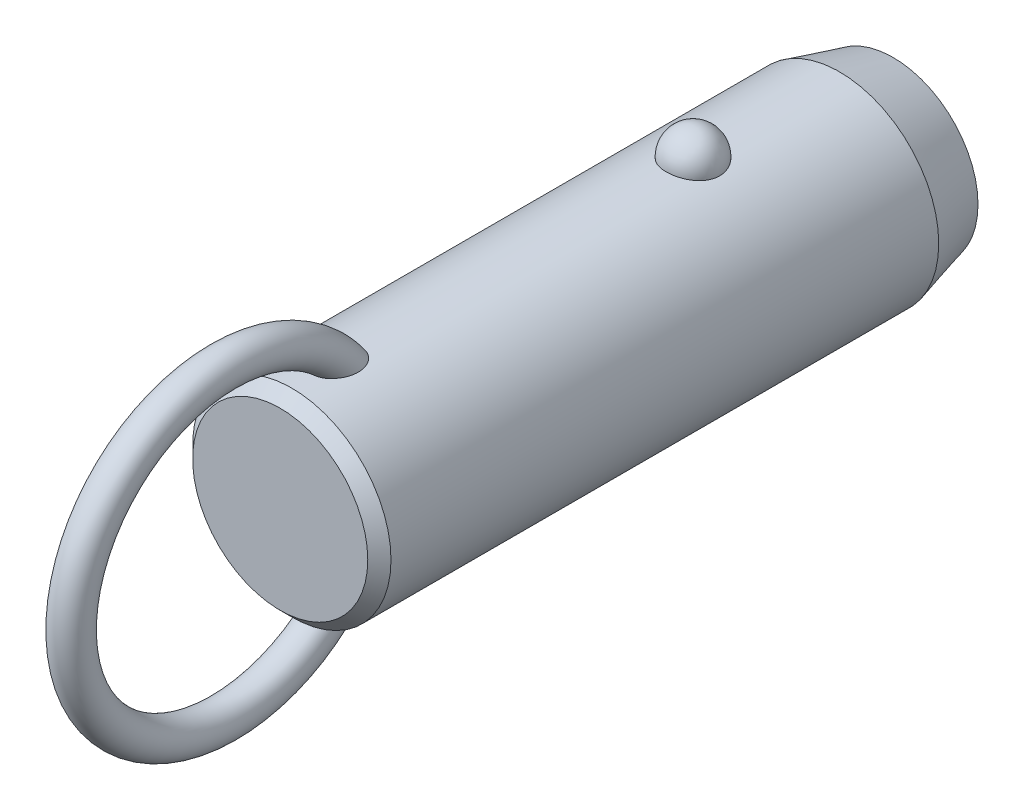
ISO-10303-21;
HEADER;
FILE_DESCRIPTION(('STEP AP214'),'2;1');
FILE_NAME('part.step','',(''),(''),'','','');
FILE_SCHEMA(('AUTOMOTIVE_DESIGN { 1 0 10303 214 1 1 1 1 }'));
ENDSEC;
DATA;
#1=APPLICATION_CONTEXT('core data for automotive mechanical design processes');
#2=APPLICATION_PROTOCOL_DEFINITION('international standard','automotive_design',2000,#1);
#3=PRODUCT_CONTEXT('',#1,'mechanical');
#4=PRODUCT('Part','Part','',(#3));
#5=PRODUCT_RELATED_PRODUCT_CATEGORY('part','',(#4));
#6=PRODUCT_DEFINITION_FORMATION('','',#4);
#7=PRODUCT_DEFINITION_CONTEXT('part definition',#1,'design');
#8=PRODUCT_DEFINITION('design','',#6,#7);
#9=PRODUCT_DEFINITION_SHAPE('','',#8);
#10=(LENGTH_UNIT() NAMED_UNIT(*) SI_UNIT(.MILLI.,.METRE.));
#11=(NAMED_UNIT(*) PLANE_ANGLE_UNIT() SI_UNIT($,.RADIAN.));
#12=(NAMED_UNIT(*) SI_UNIT($,.STERADIAN.) SOLID_ANGLE_UNIT());
#13=UNCERTAINTY_MEASURE_WITH_UNIT(LENGTH_MEASURE(1.E-05),#10,'distance_accuracy_value','');
#14=(GEOMETRIC_REPRESENTATION_CONTEXT(3) GLOBAL_UNCERTAINTY_ASSIGNED_CONTEXT((#13)) GLOBAL_UNIT_ASSIGNED_CONTEXT((#10,
#11,#12)) REPRESENTATION_CONTEXT('',''));
#15=CARTESIAN_POINT('',(0.,0.,0.));
#16=DIRECTION('',(0.,0.,1.));
#17=DIRECTION('',(1.,0.,0.));
#18=AXIS2_PLACEMENT_3D('',#15,#16,#17);
#19=CARTESIAN_POINT('',(0.,0.,30.5));
#20=DIRECTION('',(0.,0.,-1.));
#21=DIRECTION('',(-1.,0.,0.));
#22=AXIS2_PLACEMENT_3D('',#19,#20,#21);
#23=CYLINDRICAL_SURFACE('',#22,11.1);
#24=CARTESIAN_POINT('',(2.9724815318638,10.6945945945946,-3.));
#25=CARTESIAN_POINT('',(2.9724783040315,10.6945972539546,-2.83225059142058));
#26=CARTESIAN_POINT('',(2.95876598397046,10.6984356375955,-2.6644597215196));
#27=CARTESIAN_POINT('',(2.90424529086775,10.7133624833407,-2.33362381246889));
#28=CARTESIAN_POINT('',(2.8634252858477,10.7244540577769,-2.1705808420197));
#29=CARTESIAN_POINT('',(2.75573657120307,10.7526272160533,-1.85396767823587));
#30=CARTESIAN_POINT('',(2.68887937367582,10.7697061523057,-1.70039333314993));
#31=CARTESIAN_POINT('',(2.53079696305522,10.8079438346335,-1.40691598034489));
#32=CARTESIAN_POINT('',(2.43957264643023,10.8291024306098,-1.2670124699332));
#33=CARTESIAN_POINT('',(2.23458150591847,10.8732541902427,-1.00409565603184));
#34=CARTESIAN_POINT('',(2.12071295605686,10.8962553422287,-0.881162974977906));
#35=CARTESIAN_POINT('',(1.87365402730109,10.9414421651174,-0.656352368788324));
#36=CARTESIAN_POINT('',(1.74046358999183,10.9636278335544,-0.554474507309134));
#37=CARTESIAN_POINT('',(1.45872188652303,11.0046495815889,-0.374872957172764));
#38=CARTESIAN_POINT('',(1.31021276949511,11.0234944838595,-0.29708522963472));
#39=CARTESIAN_POINT('',(1.00170030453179,11.0557957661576,-0.167529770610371));
#40=CARTESIAN_POINT('',(0.841698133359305,11.0692526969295,-0.115759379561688));
#41=CARTESIAN_POINT('',(0.517607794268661,11.0890932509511,-0.0403925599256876));
#42=CARTESIAN_POINT('',(0.353633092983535,11.0955916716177,-0.0163383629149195));
#43=CARTESIAN_POINT('',(0.0238420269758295,11.1011989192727,0.0044517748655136));
#44=CARTESIAN_POINT('',(-0.141974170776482,11.1003084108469,0.00119017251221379));
#45=CARTESIAN_POINT('',(-0.468405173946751,11.0912990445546,-0.0323233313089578));
#46=CARTESIAN_POINT('',(-0.629059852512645,11.0832767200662,-0.062214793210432));
#47=CARTESIAN_POINT('',(-0.942937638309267,11.0609962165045,-0.147645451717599));
#48=CARTESIAN_POINT('',(-1.09616062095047,11.0467379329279,-0.203185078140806));
#49=CARTESIAN_POINT('',(-1.39181061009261,11.0134071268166,-0.338752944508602));
#50=CARTESIAN_POINT('',(-1.53417383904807,10.9943086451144,-0.418913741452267));
#51=CARTESIAN_POINT('',(-1.80342160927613,10.9533667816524,-0.601448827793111));
#52=CARTESIAN_POINT('',(-1.9303046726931,10.9315231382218,-0.703825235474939));
#53=CARTESIAN_POINT('',(-2.16747598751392,10.887005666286,-0.930091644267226));
#54=CARTESIAN_POINT('',(-2.27742774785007,10.8643239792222,-1.05433291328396));
#55=CARTESIAN_POINT('',(-2.47517316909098,10.8209886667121,-1.31966633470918));
#56=CARTESIAN_POINT('',(-2.56296538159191,10.8003351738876,-1.46075958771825));
#57=CARTESIAN_POINT('',(-2.71500300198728,10.7631304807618,-1.75753646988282));
#58=CARTESIAN_POINT('',(-2.77898901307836,10.7466250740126,-1.91335887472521));
#59=CARTESIAN_POINT('',(-2.88046189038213,10.7198747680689,-2.2339152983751));
#60=CARTESIAN_POINT('',(-2.91794947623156,10.709629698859,-2.39864907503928));
#61=CARTESIAN_POINT('',(-2.96537819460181,10.6965949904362,-2.73165170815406));
#62=CARTESIAN_POINT('',(-2.97542891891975,10.693775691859,-2.89990378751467));
#63=CARTESIAN_POINT('',(-2.96804271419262,10.6958279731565,-3.235752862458));
#64=CARTESIAN_POINT('',(-2.95060646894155,10.7006993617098,-3.40334987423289));
#65=CARTESIAN_POINT('',(-2.88883358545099,10.71753912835,-3.73233906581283));
#66=CARTESIAN_POINT('',(-2.84462026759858,10.7294749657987,-3.89375610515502));
#67=CARTESIAN_POINT('',(-2.73050447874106,10.7590797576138,-4.20667949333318));
#68=CARTESIAN_POINT('',(-2.66060103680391,10.7767489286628,-4.35818546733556));
#69=CARTESIAN_POINT('',(-2.49642559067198,10.8159599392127,-4.6478542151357));
#70=CARTESIAN_POINT('',(-2.40203047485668,10.8375211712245,-4.78594458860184));
#71=CARTESIAN_POINT('',(-2.19143488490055,10.8820570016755,-5.0441038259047));
#72=CARTESIAN_POINT('',(-2.07523364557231,10.9050316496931,-5.16417205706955));
#73=CARTESIAN_POINT('',(-1.82361254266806,10.9499219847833,-5.38334833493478));
#74=CARTESIAN_POINT('',(-1.68812945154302,10.9718338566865,-5.48238464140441));
#75=CARTESIAN_POINT('',(-1.40191298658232,11.0120611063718,-5.65618873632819));
#76=CARTESIAN_POINT('',(-1.25118062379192,11.0303767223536,-5.73095813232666));
#77=CARTESIAN_POINT('',(-0.940570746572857,11.0611653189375,-5.85334725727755));
#78=CARTESIAN_POINT('',(-0.780821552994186,11.0737044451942,-5.90127578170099));
#79=CARTESIAN_POINT('',(-0.455204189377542,11.0918598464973,-5.96992976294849));
#80=CARTESIAN_POINT('',(-0.289336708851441,11.0974768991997,-5.99065827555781));
#81=CARTESIAN_POINT('',(0.0406846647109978,11.1011307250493,-6.00418773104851));
#82=CARTESIAN_POINT('',(0.20481742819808,11.099299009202,-5.99747318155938));
#83=CARTESIAN_POINT('',(0.529553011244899,11.088551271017,-5.9574031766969));
#84=CARTESIAN_POINT('',(0.69015594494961,11.0796354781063,-5.92404858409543));
#85=CARTESIAN_POINT('',(1.0027760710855,11.0557204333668,-5.83180084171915));
#86=CARTESIAN_POINT('',(1.15482001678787,11.0407414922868,-5.77299291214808));
#87=CARTESIAN_POINT('',(1.44678373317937,11.0062913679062,-5.63147366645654));
#88=CARTESIAN_POINT('',(1.58670279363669,10.9868199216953,-5.54876095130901));
#89=CARTESIAN_POINT('',(1.8527023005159,10.9451315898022,-5.36027644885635));
#90=CARTESIAN_POINT('',(1.97855158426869,10.9228788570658,-5.25418644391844));
#91=CARTESIAN_POINT('',(2.21080872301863,10.8782509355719,-5.02251354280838));
#92=CARTESIAN_POINT('',(2.31721312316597,10.8558757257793,-4.89692718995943));
#93=CARTESIAN_POINT('',(2.50945517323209,10.8130715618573,-4.62745408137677));
#94=CARTESIAN_POINT('',(2.59493284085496,10.7926798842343,-4.48330448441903));
#95=CARTESIAN_POINT('',(2.740862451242,10.7565495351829,-4.18236358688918));
#96=CARTESIAN_POINT('',(2.80132490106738,10.7408089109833,-4.02557762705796));
#97=CARTESIAN_POINT('',(2.88959070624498,10.7173718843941,-3.72475308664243));
#98=CARTESIAN_POINT('',(2.92062102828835,10.7088950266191,-3.58171216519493));
#99=CARTESIAN_POINT('',(2.96206765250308,10.6975052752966,-3.29245795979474));
#100=CARTESIAN_POINT('',(2.97248434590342,10.6945922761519,-3.14624473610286));
#101=CARTESIAN_POINT('',(2.9724815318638,10.6945945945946,-3.));
#102=B_SPLINE_CURVE_WITH_KNOTS('',3,(#24,#25,#26,#27,#28,#29,#30,#31,#32,#33,#34,#35,#36,#37,
#38,#39,#40,#41,#42,#43,#44,#45,#46,#47,#48,#49,#50,#51,#52,#53,#54,#55,#56,#57,#58,#59,#60,#61,
#62,#63,#64,#65,#66,#67,#68,#69,#70,#71,#72,#73,#74,#75,#76,#77,#78,#79,#80,#81,#82,#83,#84,#85,
#86,#87,#88,#89,#90,#91,#92,#93,#94,#95,#96,#97,#98,#99,#100,#101),.UNSPECIFIED.,.T.,.F.,(4,2,2,
2,2,2,2,2,2,2,2,2,2,2,2,2,2,2,2,2,2,2,2,2,2,2,2,2,2,2,2,2,2,2,2,2,2,2,4),(0.,0.502722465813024,
1.00566079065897,1.5083769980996,2.01107471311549,2.51608392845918,3.02109467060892,
3.52475118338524,4.02835620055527,4.52351860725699,5.0186364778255,5.50715297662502,
5.99567766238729,6.48688002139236,6.97812923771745,7.47814366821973,7.97819077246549,
8.48353712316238,8.9888697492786,9.49218093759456,9.99547960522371,10.4964777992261,
10.997494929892,11.5010810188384,12.0046847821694,12.5099796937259,13.0152411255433,
13.5145635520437,14.0138298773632,14.5043200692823,14.9947943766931,15.4836390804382,
15.9725123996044,16.4685040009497,16.9645836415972,17.4686765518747,17.972557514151,
18.410841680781,18.849117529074),.UNSPECIFIED.);
#103=CARTESIAN_POINT('',(2.9724815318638,10.6945945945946,-3.));
#104=VERTEX_POINT('',#103);
#105=EDGE_CURVE('E41',#104,#104,#102,.T.);
#106=ORIENTED_EDGE('',*,*,#105,.T.);
#107=EDGE_LOOP('',(#106));
#108=FACE_BOUND('',#107,.T.);
#109=CARTESIAN_POINT('',(0.,0.,41.9000000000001));
#110=DIRECTION('',(0.,0.,1.));
#111=DIRECTION('',(1.,0.,0.));
#112=AXIS2_PLACEMENT_3D('',#109,#110,#111);
#113=CIRCLE('',#112,11.1);
#114=CARTESIAN_POINT('',(11.1,0.,41.9000000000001));
#115=VERTEX_POINT('',#114);
#116=EDGE_CURVE('E10',#115,#115,#113,.F.);
#117=ORIENTED_EDGE('',*,*,#116,.T.);
#118=EDGE_LOOP('',(#117));
#119=FACE_BOUND('',#118,.T.);
#120=CARTESIAN_POINT('',(-0.56452033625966,-11.0856356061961,34.157815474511));
#121=CARTESIAN_POINT('',(-0.66720283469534,-11.0804062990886,34.1912839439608));
#122=CARTESIAN_POINT('',(-0.766875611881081,-11.0738877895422,34.2338357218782));
#123=CARTESIAN_POINT('',(-0.957284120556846,-11.0590576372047,34.3354190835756));
#124=CARTESIAN_POINT('',(-1.04801616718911,-11.0507452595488,34.3944574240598));
#125=CARTESIAN_POINT('',(-1.21800952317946,-11.0333016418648,34.5265293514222));
#126=CARTESIAN_POINT('',(-1.29730805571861,-11.0241732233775,34.5995156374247));
#127=CARTESIAN_POINT('',(-1.44337665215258,-11.0060026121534,34.7570374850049));
#128=CARTESIAN_POINT('',(-1.51014622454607,-10.9969604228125,34.8415734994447));
#129=CARTESIAN_POINT('',(-1.63454620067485,-10.9791841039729,35.0255213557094));
#130=CARTESIAN_POINT('',(-1.69127003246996,-10.9705107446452,35.1255493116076));
#131=CARTESIAN_POINT('',(-1.78980785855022,-10.9548648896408,35.3327902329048));
#132=CARTESIAN_POINT('',(-1.83161214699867,-10.9478935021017,35.4400078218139));
#133=CARTESIAN_POINT('',(-1.91557028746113,-10.9335803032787,35.7054080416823));
#134=CARTESIAN_POINT('',(-1.95040620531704,-10.9273269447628,35.8659806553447));
#135=CARTESIAN_POINT('',(-1.99388326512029,-10.9194709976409,36.1906977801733));
#136=CARTESIAN_POINT('',(-2.00248051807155,-10.9178762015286,36.3548478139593));
#137=CARTESIAN_POINT('',(-1.99551615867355,-10.9191578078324,36.7246504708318));
#138=CARTESIAN_POINT('',(-1.9732206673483,-10.9232807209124,36.9301911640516));
#139=CARTESIAN_POINT('',(-1.9152976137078,-10.9335244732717,37.233595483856));
#140=CARTESIAN_POINT('',(-1.89184575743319,-10.9376266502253,37.3340883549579));
#141=CARTESIAN_POINT('',(-1.83700674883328,-10.9469720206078,37.532855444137));
#142=CARTESIAN_POINT('',(-1.80562070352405,-10.9522150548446,37.6311299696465));
#143=CARTESIAN_POINT('',(-1.73463055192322,-10.9636837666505,37.8259148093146));
#144=CARTESIAN_POINT('',(-1.69493416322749,-10.9699202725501,37.9223907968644));
#145=CARTESIAN_POINT('',(-1.60745141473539,-10.9830806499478,38.1116262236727));
#146=CARTESIAN_POINT('',(-1.55966150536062,-10.9900048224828,38.2043840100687));
#147=CARTESIAN_POINT('',(-1.45591812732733,-11.0042280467,38.3846907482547));
#148=CARTESIAN_POINT('',(-1.40000013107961,-11.0115253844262,38.4722601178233));
#149=CARTESIAN_POINT('',(-1.2793747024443,-11.0261911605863,38.641029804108));
#150=CARTESIAN_POINT('',(-1.21467835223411,-11.0335594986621,38.7222379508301));
#151=CARTESIAN_POINT('',(-1.08218150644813,-11.0473027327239,38.8690010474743));
#152=CARTESIAN_POINT('',(-1.0152263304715,-11.0537063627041,38.9353092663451));
#153=CARTESIAN_POINT('',(-0.872952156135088,-11.065850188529,39.0583780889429));
#154=CARTESIAN_POINT('',(-0.797642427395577,-11.0715911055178,39.1151491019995));
#155=CARTESIAN_POINT('',(-0.651396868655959,-11.081071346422,39.2075155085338));
#156=CARTESIAN_POINT('',(-0.581712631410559,-11.0849841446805,39.2450491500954));
#157=CARTESIAN_POINT('',(-0.437066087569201,-11.0916271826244,39.3082594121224));
#158=CARTESIAN_POINT('',(-0.362109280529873,-11.0943586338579,39.3339481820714));
#159=CARTESIAN_POINT('',(-0.207828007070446,-11.0983242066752,39.371117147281));
#160=CARTESIAN_POINT('',(-0.128467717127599,-11.0995432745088,39.3824545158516));
#161=CARTESIAN_POINT('',(0.0309101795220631,-11.1002423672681,39.3889658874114));
#162=CARTESIAN_POINT('',(0.110927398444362,-11.0997233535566,39.3841488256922));
#163=CARTESIAN_POINT('',(0.256406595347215,-11.097240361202,39.3609599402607));
#164=CARTESIAN_POINT('',(0.322235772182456,-11.0955074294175,39.3447543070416));
#165=CARTESIAN_POINT('',(0.450635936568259,-11.0910350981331,39.3026008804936));
#166=CARTESIAN_POINT('',(0.513205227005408,-11.0882951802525,39.2766480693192));
#167=CARTESIAN_POINT('',(0.662626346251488,-11.0805620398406,39.2026073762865));
#168=CARTESIAN_POINT('',(0.747127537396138,-11.0751144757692,39.1498452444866));
#169=CARTESIAN_POINT('',(0.906756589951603,-11.0631932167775,39.0317206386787));
#170=CARTESIAN_POINT('',(0.981859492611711,-11.0567168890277,38.9663257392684));
#171=CARTESIAN_POINT('',(1.1071220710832,-11.0447856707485,38.8422633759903));
#172=CARTESIAN_POINT('',(1.15909566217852,-11.0394280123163,38.7853831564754));
#173=CARTESIAN_POINT('',(1.25791923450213,-11.0286040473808,38.6673271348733));
#174=CARTESIAN_POINT('',(1.30476642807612,-11.0231376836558,38.6061490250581));
#175=CARTESIAN_POINT('',(1.43818612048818,-11.0068027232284,38.417305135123));
#176=CARTESIAN_POINT('',(1.51751767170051,-10.9960104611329,38.2844531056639));
#177=CARTESIAN_POINT('',(1.63597546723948,-10.9788847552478,38.0531371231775));
#178=CARTESIAN_POINT('',(1.67988876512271,-10.9722190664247,37.9570530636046));
#179=CARTESIAN_POINT('',(1.75953241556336,-10.9597298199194,37.7614311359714));
#180=CARTESIAN_POINT('',(1.79525967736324,-10.9539065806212,37.6618919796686));
#181=CARTESIAN_POINT('',(1.85844731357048,-10.9433632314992,37.4602111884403));
#182=CARTESIAN_POINT('',(1.88591073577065,-10.9386427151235,37.3580705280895));
#183=CARTESIAN_POINT('',(1.93234324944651,-10.9305350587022,37.151819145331));
#184=CARTESIAN_POINT('',(1.95131065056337,-10.9271481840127,37.0477080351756));
#185=CARTESIAN_POINT('',(1.99040203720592,-10.9201183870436,36.7654588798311));
#186=CARTESIAN_POINT('',(2.00221217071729,-10.9179256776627,36.5860370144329));
#187=CARTESIAN_POINT('',(1.99711676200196,-10.9188636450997,36.2277133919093));
#188=CARTESIAN_POINT('',(1.98026150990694,-10.9219849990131,36.0488112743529));
#189=CARTESIAN_POINT('',(1.92151657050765,-10.9324473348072,35.7364514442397));
#190=CARTESIAN_POINT('',(1.88605081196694,-10.9386915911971,35.6017594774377));
#191=CARTESIAN_POINT('',(1.79393020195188,-10.9541780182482,35.3399669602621));
#192=CARTESIAN_POINT('',(1.73729868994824,-10.9634168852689,35.2128582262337));
#193=CARTESIAN_POINT('',(1.61237037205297,-10.9824218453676,34.9894184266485));
#194=CARTESIAN_POINT('',(1.54715374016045,-10.9918945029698,34.8913455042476));
#195=CARTESIAN_POINT('',(1.40127026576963,-11.0114415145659,34.7074341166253));
#196=CARTESIAN_POINT('',(1.3206074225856,-11.0215157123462,34.6215924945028));
#197=CARTESIAN_POINT('',(1.1447478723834,-11.041168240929,34.4651630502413));
#198=CARTESIAN_POINT('',(1.0494780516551,-11.0507437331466,34.3946565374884));
#199=CARTESIAN_POINT('',(0.847278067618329,-11.0680789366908,34.272640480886));
#200=CARTESIAN_POINT('',(0.740351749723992,-11.0758392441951,34.2211246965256));
#201=CARTESIAN_POINT('',(0.52928931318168,-11.0878275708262,34.1434852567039));
#202=CARTESIAN_POINT('',(0.425895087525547,-11.0923259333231,34.115377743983));
#203=CARTESIAN_POINT('',(0.215723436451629,-11.0984001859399,34.0777038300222));
#204=CARTESIAN_POINT('',(0.108947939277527,-11.0999777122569,34.0681270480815));
#205=CARTESIAN_POINT('',(-0.0938962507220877,-11.1000196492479,34.0678773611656));
#206=CARTESIAN_POINT('',(-0.189967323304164,-11.0987797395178,34.0754089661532));
#207=CARTESIAN_POINT('',(-0.3796579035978,-11.0939111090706,34.1055079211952));
#208=CARTESIAN_POINT('',(-0.473277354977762,-11.0902823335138,34.1280756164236));
#209=CARTESIAN_POINT('',(-0.56452033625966,-11.0856356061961,34.157815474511));
#210=B_SPLINE_CURVE_WITH_KNOTS('',3,(#120,#121,#122,#123,#124,#125,#126,#127,#128,#129,#130,
#131,#132,#133,#134,#135,#136,#137,#138,#139,#140,#141,#142,#143,#144,#145,#146,#147,#148,#149,
#150,#151,#152,#153,#154,#155,#156,#157,#158,#159,#160,#161,#162,#163,#164,#165,#166,#167,#168,
#169,#170,#171,#172,#173,#174,#175,#176,#177,#178,#179,#180,#181,#182,#183,#184,#185,#186,#187,
#188,#189,#190,#191,#192,#193,#194,#195,#196,#197,#198,#199,#200,#201,#202,#203,#204,#205,#206,
#207,#208,#209),.UNSPECIFIED.,.T.,.F.,(4,2,2,2,2,2,2,2,2,2,2,2,2,2,2,2,2,2,2,2,2,2,2,2,2,2,2,2,
2,2,2,2,2,2,2,2,2,2,2,2,2,2,2,2,4),(0.,0.323999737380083,0.648132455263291,0.971184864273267,
1.29424994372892,1.6388623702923,1.98369857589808,2.4742605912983,2.96564271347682,
3.58257396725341,3.89215258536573,4.20168803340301,4.51486273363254,4.82817514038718,
5.14015911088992,5.45175282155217,5.734428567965,6.01679375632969,6.25364580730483,
6.49025437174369,6.72919963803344,6.9680127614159,7.17061258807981,7.37331685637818,
7.67094989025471,7.96935728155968,8.20075067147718,8.4322692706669,8.8958162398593,
9.21306533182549,9.53043400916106,9.84768549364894,10.1650000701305,10.70229304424,
11.2386443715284,11.6553390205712,12.0715755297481,12.4245637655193,12.7774607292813,
13.1321855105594,13.4867936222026,13.8068771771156,14.1267813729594,14.4146787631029,
14.7025827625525),.UNSPECIFIED.);
#211=CARTESIAN_POINT('',(-0.56452033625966,-11.0856356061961,34.157815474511));
#212=VERTEX_POINT('',#211);
#213=EDGE_CURVE('E60',#212,#212,#210,.T.);
#214=ORIENTED_EDGE('',*,*,#213,.T.);
#215=EDGE_LOOP('',(#214));
#216=FACE_BOUND('',#215,.T.);
#217=CARTESIAN_POINT('',(-0.56452033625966,11.0856356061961,34.157815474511));
#218=CARTESIAN_POINT('',(-0.468542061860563,11.0905203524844,34.1265456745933));
#219=CARTESIAN_POINT('',(-0.369793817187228,11.0942886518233,34.1031576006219));
#220=CARTESIAN_POINT('',(-0.16955579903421,11.0991586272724,34.0730858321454));
#221=CARTESIAN_POINT('',(-0.0680604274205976,11.1002543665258,34.0664393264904));
#222=CARTESIAN_POINT('',(0.134549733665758,11.099646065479,34.0701579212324));
#223=CARTESIAN_POINT('',(0.235664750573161,11.0979441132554,34.0805103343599));
#224=CARTESIAN_POINT('',(0.434632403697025,11.0919342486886,34.1178318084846));
#225=CARTESIAN_POINT('',(0.532486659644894,11.0876276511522,34.1447924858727));
#226=CARTESIAN_POINT('',(0.722445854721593,11.0768742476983,34.2144096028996));
#227=CARTESIAN_POINT('',(0.814543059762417,11.0704246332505,34.2570866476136));
#228=CARTESIAN_POINT('',(0.990565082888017,11.0560659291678,34.3566487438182));
#229=CARTESIAN_POINT('',(1.07448844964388,11.048156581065,34.4135363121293));
#230=CARTESIAN_POINT('',(1.23562672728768,11.0313221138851,34.5422106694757));
#231=CARTESIAN_POINT('',(1.31242684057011,11.0223686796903,34.6145117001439));
#232=CARTESIAN_POINT('',(1.45398030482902,11.0045918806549,34.7700425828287));
#233=CARTESIAN_POINT('',(1.51873073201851,10.9957685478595,34.8532750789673));
#234=CARTESIAN_POINT('',(1.64107232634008,10.9782087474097,35.0363842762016));
#235=CARTESIAN_POINT('',(1.6974317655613,10.9695572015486,35.1370893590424));
#236=CARTESIAN_POINT('',(1.79515063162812,10.9539887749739,35.3456264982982));
#237=CARTESIAN_POINT('',(1.83649966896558,10.9470730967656,35.4534634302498));
#238=CARTESIAN_POINT('',(1.91931148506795,10.9329211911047,35.7203995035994));
#239=CARTESIAN_POINT('',(1.95340104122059,10.9267904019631,35.8818612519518));
#240=CARTESIAN_POINT('',(1.99526195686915,10.9192174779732,36.2082163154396));
#241=CARTESIAN_POINT('',(2.00298989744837,10.9177830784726,36.3731148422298));
#242=CARTESIAN_POINT('',(1.99396251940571,10.9194420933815,36.7441006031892));
#243=CARTESIAN_POINT('',(1.97050829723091,10.923774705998,36.9500387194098));
#244=CARTESIAN_POINT('',(1.91079643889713,10.9343131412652,37.2539019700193));
#245=CARTESIAN_POINT('',(1.8867370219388,10.9385106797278,37.3545296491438));
#246=CARTESIAN_POINT('',(1.83065508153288,10.9480376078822,37.5535107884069));
#247=CARTESIAN_POINT('',(1.79863369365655,10.9533668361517,37.651864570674));
#248=CARTESIAN_POINT('',(1.72633365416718,10.9649954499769,37.8467203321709));
#249=CARTESIAN_POINT('',(1.68596409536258,10.9713053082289,37.9431879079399));
#250=CARTESIAN_POINT('',(1.59707998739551,10.9845964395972,38.1323233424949));
#251=CARTESIAN_POINT('',(1.54856169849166,10.9915780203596,38.2249894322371));
#252=CARTESIAN_POINT('',(1.4433016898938,11.0058935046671,38.4049752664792));
#253=CARTESIAN_POINT('',(1.38659749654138,11.0132257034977,38.492316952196));
#254=CARTESIAN_POINT('',(1.26431158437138,11.0279330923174,38.6604563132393));
#255=CARTESIAN_POINT('',(1.198741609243,11.0353082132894,38.7412624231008));
#256=CARTESIAN_POINT('',(1.06542088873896,11.048931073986,38.8859856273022));
#257=CARTESIAN_POINT('',(0.998640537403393,11.0552153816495,38.950784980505));
#258=CARTESIAN_POINT('',(0.856896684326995,11.0671032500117,39.0708462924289));
#259=CARTESIAN_POINT('',(0.781942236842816,11.0727075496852,39.1261186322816));
#260=CARTESIAN_POINT('',(0.636276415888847,11.081949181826,39.2159721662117));
#261=CARTESIAN_POINT('',(0.566755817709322,11.0857572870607,39.2524410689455));
#262=CARTESIAN_POINT('',(0.422602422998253,11.0921860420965,39.3135333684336));
#263=CARTESIAN_POINT('',(0.347974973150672,11.0948079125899,39.3381689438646));
#264=CARTESIAN_POINT('',(0.194593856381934,11.0985608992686,39.3733233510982));
#265=CARTESIAN_POINT('',(0.11580793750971,11.0996777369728,39.3837069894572));
#266=CARTESIAN_POINT('',(-0.042249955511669,11.1002003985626,39.3885747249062));
#267=CARTESIAN_POINT('',(-0.121521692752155,11.09960699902,39.383066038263));
#268=CARTESIAN_POINT('',(-0.266046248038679,11.0970123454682,39.3588271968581));
#269=CARTESIAN_POINT('',(-0.331661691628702,11.0952283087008,39.3421356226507));
#270=CARTESIAN_POINT('',(-0.45958809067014,11.0906663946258,39.2991117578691));
#271=CARTESIAN_POINT('',(-0.521897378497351,11.0878880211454,39.272774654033));
#272=CARTESIAN_POINT('',(-0.67144642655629,11.0800342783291,39.1975130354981));
#273=CARTESIAN_POINT('',(-0.756250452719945,11.0744969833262,39.143818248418));
#274=CARTESIAN_POINT('',(-0.916349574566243,11.0624045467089,39.0238029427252));
#275=CARTESIAN_POINT('',(-0.991618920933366,11.0558467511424,38.9574493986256));
#276=CARTESIAN_POINT('',(-1.11713140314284,11.0437783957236,38.8316335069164));
#277=CARTESIAN_POINT('',(-1.16920539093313,11.0383619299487,38.7739524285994));
#278=CARTESIAN_POINT('',(-1.26817476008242,11.02743010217,38.6542809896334));
#279=CARTESIAN_POINT('',(-1.315067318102,11.0219146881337,38.5922883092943));
#280=CARTESIAN_POINT('',(-1.40399813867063,11.0109399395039,38.4647843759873));
#281=CARTESIAN_POINT('',(-1.4460286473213,11.0054807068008,38.3992677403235));
#282=CARTESIAN_POINT('',(-1.52538779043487,10.9947621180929,38.2654223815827));
#283=CARTESIAN_POINT('',(-1.56271516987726,10.9895028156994,38.1970929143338));
#284=CARTESIAN_POINT('',(-1.64537943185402,10.9774790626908,38.0332101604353));
#285=CARTESIAN_POINT('',(-1.68879497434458,10.9708503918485,37.9366735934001));
#286=CARTESIAN_POINT('',(-1.76740738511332,10.9584602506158,37.7402369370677));
#287=CARTESIAN_POINT('',(-1.80260120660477,10.95269910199,37.6403356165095));
#288=CARTESIAN_POINT('',(-1.86468657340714,10.9423003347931,37.4379663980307));
#289=CARTESIAN_POINT('',(-1.8915816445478,10.9376622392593,37.3354996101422));
#290=CARTESIAN_POINT('',(-1.93682458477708,10.9297405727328,37.1286429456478));
#291=CARTESIAN_POINT('',(-1.95517082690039,10.9264572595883,37.0242527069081));
#292=CARTESIAN_POINT('',(-1.99232562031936,10.9197647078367,36.7426287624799));
#293=CARTESIAN_POINT('',(-2.00294603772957,10.9177914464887,36.5641857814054));
#294=CARTESIAN_POINT('',(-1.99566675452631,10.9191290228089,36.2079962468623));
#295=CARTESIAN_POINT('',(-1.97781651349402,10.9224306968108,36.0302490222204));
#296=CARTESIAN_POINT('',(-1.91747214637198,10.9331592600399,35.7197921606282));
#297=CARTESIAN_POINT('',(-1.88131022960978,10.9395108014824,35.585825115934));
#298=CARTESIAN_POINT('',(-1.78790380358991,10.9551659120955,35.3255975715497));
#299=CARTESIAN_POINT('',(-1.73068309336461,10.9644661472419,35.1993285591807));
#300=CARTESIAN_POINT('',(-1.60475573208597,10.9835398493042,34.9774156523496));
#301=CARTESIAN_POINT('',(-1.53908879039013,10.9930297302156,34.8800265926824));
#302=CARTESIAN_POINT('',(-1.39238608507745,11.0125708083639,34.6975250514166));
#303=CARTESIAN_POINT('',(-1.31135150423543,11.0226219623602,34.6124116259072));
#304=CARTESIAN_POINT('',(-1.14382035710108,11.0411991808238,34.4652994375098));
#305=CARTESIAN_POINT('',(-1.05858500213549,11.0497792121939,34.4018693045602));
#306=CARTESIAN_POINT('',(-0.878723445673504,11.0655285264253,34.2902505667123));
#307=CARTESIAN_POINT('',(-0.784123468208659,11.0727015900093,34.2420208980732));
#308=CARTESIAN_POINT('',(-0.646163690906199,11.0812501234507,34.186023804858));
#309=CARTESIAN_POINT('',(-0.605595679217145,11.0835451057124,34.1711978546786));
#310=CARTESIAN_POINT('',(-0.56452033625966,11.0856356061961,34.157815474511));
#311=B_SPLINE_CURVE_WITH_KNOTS('',3,(#217,#218,#219,#220,#221,#222,#223,#224,#225,#226,#227,
#228,#229,#230,#231,#232,#233,#234,#235,#236,#237,#238,#239,#240,#241,#242,#243,#244,#245,#246,
#247,#248,#249,#250,#251,#252,#253,#254,#255,#256,#257,#258,#259,#260,#261,#262,#263,#264,#265,
#266,#267,#268,#269,#270,#271,#272,#273,#274,#275,#276,#277,#278,#279,#280,#281,#282,#283,#284,
#285,#286,#287,#288,#289,#290,#291,#292,#293,#294,#295,#296,#297,#298,#299,#300,#301,#302,#303,
#304,#305,#306,#307,#308,#309,#310),.UNSPECIFIED.,.T.,.F.,(4,2,2,2,2,2,2,2,2,2,2,2,2,2,2,2,2,2,
2,2,2,2,2,2,2,2,2,2,2,2,2,2,2,2,2,2,2,2,2,2,2,2,2,2,2,2,4),(0.,0.303061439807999,
0.606795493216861,0.910302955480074,1.21365733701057,1.51741085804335,1.82121821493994,
2.13745205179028,2.45376252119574,2.799586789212,3.14564996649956,3.63832391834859,
4.13180893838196,4.75031912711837,5.06071926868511,5.37107516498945,5.68500772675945,
5.99908475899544,6.3117651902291,6.62403542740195,6.90315673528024,7.18197194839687,
7.41687778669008,7.6515413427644,7.8884158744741,8.12518286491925,8.32752842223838,
8.52997509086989,8.82986421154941,9.13054668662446,9.36393502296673,9.59744991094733,
9.83133221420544,10.0652767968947,10.383032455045,10.7009056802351,11.0186436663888,
11.3364420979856,11.8705925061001,12.4038159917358,12.8189662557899,13.2336487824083,
13.5857049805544,13.9377340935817,14.2561354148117,14.5736690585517,14.7033687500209),.UNSPECIFIED.);
#312=CARTESIAN_POINT('',(-0.56452033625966,11.0856356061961,34.157815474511));
#313=VERTEX_POINT('',#312);
#314=EDGE_CURVE('E68',#313,#313,#311,.T.);
#315=ORIENTED_EDGE('',*,*,#314,.T.);
#316=EDGE_LOOP('',(#315));
#317=FACE_BOUND('',#316,.T.);
#318=CARTESIAN_POINT('',(0.,0.,-19.4));
#319=DIRECTION('',(0.,0.,-1.));
#320=DIRECTION('',(-1.,0.,0.));
#321=AXIS2_PLACEMENT_3D('',#318,#319,#320);
#322=CIRCLE('',#321,11.1);
#323=CARTESIAN_POINT('',(11.1,0.,-19.4));
#324=VERTEX_POINT('',#323);
#325=EDGE_CURVE('E57',#324,#324,#322,.F.);
#326=ORIENTED_EDGE('',*,*,#325,.T.);
#327=EDGE_LOOP('',(#326));
#328=FACE_BOUND('',#327,.T.);
#329=ADVANCED_FACE('F37',(#108,#119,#216,#317,#328),#23,.T.);
#330=CARTESIAN_POINT('',(0.,0.,-25.4));
#331=DIRECTION('',(0.,0.,-1.));
#332=DIRECTION('',(-1.,0.,0.));
#333=AXIS2_PLACEMENT_3D('',#330,#331,#332);
#334=PLANE('',#333);
#335=CARTESIAN_POINT('',(0.,0.,-25.4));
#336=DIRECTION('',(0.,0.,-1.));
#337=DIRECTION('',(-1.,0.,0.));
#338=AXIS2_PLACEMENT_3D('',#335,#336,#337);
#339=CIRCLE('',#338,9.49230484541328);
#340=CARTESIAN_POINT('',(9.49230484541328,0.,-25.4));
#341=VERTEX_POINT('',#340);
#342=EDGE_CURVE('E67',#341,#341,#339,.T.);
#343=ORIENTED_EDGE('',*,*,#342,.T.);
#344=EDGE_LOOP('',(#343));
#345=FACE_BOUND('',#344,.T.);
#346=ADVANCED_FACE('F86',(#345),#334,.T.);
#347=CARTESIAN_POINT('',(0.,0.,-25.4));
#348=DIRECTION('',(0.,0.,1.));
#349=DIRECTION('',(1.,0.,0.));
#350=AXIS2_PLACEMENT_3D('',#347,#348,#349);
#351=CONICAL_SURFACE('',#350,9.49230484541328,0.261799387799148);
#352=CARTESIAN_POINT('',(11.1,0.,-19.4));
#353=CARTESIAN_POINT('',(11.0832531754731,0.,-19.4625));
#354=CARTESIAN_POINT('',(11.0665063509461,0.,-19.525));
#355=CARTESIAN_POINT('',(11.0330127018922,0.,-19.65));
#356=CARTESIAN_POINT('',(11.0162658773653,0.,-19.7125));
#357=CARTESIAN_POINT('',(10.9827722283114,0.,-19.8375));
#358=CARTESIAN_POINT('',(10.9660254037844,0.,-19.9));
#359=CARTESIAN_POINT('',(10.9325317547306,0.,-20.025));
#360=CARTESIAN_POINT('',(10.9157849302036,0.,-20.0875));
#361=CARTESIAN_POINT('',(10.8822912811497,0.,-20.2125));
#362=CARTESIAN_POINT('',(10.8655444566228,0.,-20.275));
#363=CARTESIAN_POINT('',(10.8320508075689,0.,-20.4));
#364=CARTESIAN_POINT('',(10.8153039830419,0.,-20.4625));
#365=CARTESIAN_POINT('',(10.781810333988,0.,-20.5875));
#366=CARTESIAN_POINT('',(10.7650635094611,0.,-20.65));
#367=CARTESIAN_POINT('',(10.7315698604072,0.,-20.775));
#368=CARTESIAN_POINT('',(10.7148230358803,0.,-20.8375));
#369=CARTESIAN_POINT('',(10.6813293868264,0.,-20.9625));
#370=CARTESIAN_POINT('',(10.6645825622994,0.,-21.025));
#371=CARTESIAN_POINT('',(10.6310889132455,0.,-21.15));
#372=CARTESIAN_POINT('',(10.6143420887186,0.,-21.2125));
#373=CARTESIAN_POINT('',(10.5808484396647,0.,-21.3375));
#374=CARTESIAN_POINT('',(10.5641016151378,0.,-21.4));
#375=CARTESIAN_POINT('',(10.5306079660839,0.,-21.525));
#376=CARTESIAN_POINT('',(10.5138611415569,0.,-21.5875));
#377=CARTESIAN_POINT('',(10.480367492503,0.,-21.7125));
#378=CARTESIAN_POINT('',(10.4636206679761,0.,-21.775));
#379=CARTESIAN_POINT('',(10.4301270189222,0.,-21.9));
#380=CARTESIAN_POINT('',(10.4133801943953,0.,-21.9625));
#381=CARTESIAN_POINT('',(10.3798865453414,0.,-22.0875));
#382=CARTESIAN_POINT('',(10.3631397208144,0.,-22.15));
#383=CARTESIAN_POINT('',(10.3296460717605,0.,-22.275));
#384=CARTESIAN_POINT('',(10.3128992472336,0.,-22.3375));
#385=CARTESIAN_POINT('',(10.2794055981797,0.,-22.4625));
#386=CARTESIAN_POINT('',(10.2626587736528,0.,-22.525));
#387=CARTESIAN_POINT('',(10.2291651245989,0.,-22.65));
#388=CARTESIAN_POINT('',(10.2124183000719,0.,-22.7125));
#389=CARTESIAN_POINT('',(10.178924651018,0.,-22.8375));
#390=CARTESIAN_POINT('',(10.1621778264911,0.,-22.9));
#391=CARTESIAN_POINT('',(10.1286841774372,0.,-23.025));
#392=CARTESIAN_POINT('',(10.1119373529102,0.,-23.0875));
#393=CARTESIAN_POINT('',(10.0784437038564,0.,-23.2125));
#394=CARTESIAN_POINT('',(10.0616968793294,0.,-23.275));
#395=CARTESIAN_POINT('',(10.0282032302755,0.,-23.4));
#396=CARTESIAN_POINT('',(10.0114564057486,0.,-23.4625));
#397=CARTESIAN_POINT('',(9.97796275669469,0.,-23.5875));
#398=CARTESIAN_POINT('',(9.96121593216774,0.,-23.65));
#399=CARTESIAN_POINT('',(9.92772228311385,0.,-23.775));
#400=CARTESIAN_POINT('',(9.91097545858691,0.,-23.8375));
#401=CARTESIAN_POINT('',(9.87748180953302,0.,-23.9625));
#402=CARTESIAN_POINT('',(9.86073498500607,0.,-24.025));
#403=CARTESIAN_POINT('',(9.82724133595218,0.,-24.15));
#404=CARTESIAN_POINT('',(9.81049451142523,0.,-24.2125));
#405=CARTESIAN_POINT('',(9.77700086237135,0.,-24.3375));
#406=CARTESIAN_POINT('',(9.7602540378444,0.,-24.4));
#407=CARTESIAN_POINT('',(9.72676038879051,0.,-24.525));
#408=CARTESIAN_POINT('',(9.71001356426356,0.,-24.5875));
#409=CARTESIAN_POINT('',(9.67651991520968,0.,-24.7125));
#410=CARTESIAN_POINT('',(9.65977309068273,0.,-24.775));
#411=CARTESIAN_POINT('',(9.62627944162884,0.,-24.9));
#412=CARTESIAN_POINT('',(9.60953261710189,0.,-24.9625));
#413=CARTESIAN_POINT('',(9.576038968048,0.,-25.0875));
#414=CARTESIAN_POINT('',(9.55929214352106,0.,-25.15));
#415=CARTESIAN_POINT('',(9.52579849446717,0.,-25.275));
#416=CARTESIAN_POINT('',(9.50905166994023,0.,-25.3375));
#417=CARTESIAN_POINT('',(9.49230484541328,0.,-25.4));
#418=B_SPLINE_CURVE_WITH_KNOTS('',3,(#352,#353,#354,#355,#356,#357,#358,#359,#360,#361,#362,
#363,#364,#365,#366,#367,#368,#369,#370,#371,#372,#373,#374,#375,#376,#377,#378,#379,#380,#381,
#382,#383,#384,#385,#386,#387,#388,#389,#390,#391,#392,#393,#394,#395,#396,#397,#398,#399,#400,
#401,#402,#403,#404,#405,#406,#407,#408,#409,#410,#411,#412,#413,#414,#415,#416,#417),
.UNSPECIFIED.,.F.,.F.,(4,2,2,2,2,2,2,2,2,2,2,2,2,2,2,2,2,2,2,2,2,2,2,2,2,2,2,2,2,2,2,2,4),(0.,
0.194114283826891,0.388228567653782,0.582342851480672,0.776457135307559,0.97057141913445,
1.16468570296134,1.35879998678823,1.55291427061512,1.74702855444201,1.9411428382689,
2.13525712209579,2.32937140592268,2.52348568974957,2.71759997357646,2.91171425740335,
3.10582854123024,3.29994282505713,3.49405710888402,3.68817139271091,3.8822856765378,
4.07639996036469,4.27051424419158,4.46462852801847,4.65874281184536,4.85285709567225,
5.04697137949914,5.24108566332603,5.43519994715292,5.62931423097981,5.8234285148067,
6.01754279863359,6.21165708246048),.UNSPECIFIED.);
#419=EDGE_CURVE('BSEAM84',#324,#341,#418,.T.);
#420=ORIENTED_EDGE('',*,*,#325,.F.);
#421=ORIENTED_EDGE('',*,*,#342,.F.);
#422=ORIENTED_EDGE('',*,*,#419,.T.);
#423=ORIENTED_EDGE('',*,*,#419,.F.);
#424=EDGE_LOOP('',(#420,#422,#421,#423));
#425=FACE_BOUND('',#424,.T.);
#426=ADVANCED_FACE('F84',(#425),#351,.T.);
#427=CARTESIAN_POINT('',(0.,0.,43.2));
#428=DIRECTION('',(0.,0.,1.));
#429=DIRECTION('',(1.,0.,0.));
#430=AXIS2_PLACEMENT_3D('',#427,#428,#429);
#431=PLANE('',#430);
#432=CARTESIAN_POINT('',(0.,0.,43.2));
#433=DIRECTION('',(0.,0.,1.));
#434=DIRECTION('',(1.,0.,0.));
#435=AXIS2_PLACEMENT_3D('',#432,#433,#434);
#436=CIRCLE('',#435,9.80000000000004);
#437=CARTESIAN_POINT('',(9.80000000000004,0.,43.2));
#438=VERTEX_POINT('',#437);
#439=EDGE_CURVE('E50',#438,#438,#436,.T.);
#440=ORIENTED_EDGE('',*,*,#439,.T.);
#441=EDGE_LOOP('',(#440));
#442=FACE_BOUND('',#441,.T.);
#443=ADVANCED_FACE('F78',(#442),#431,.T.);
#444=CARTESIAN_POINT('',(0.,0.,49.55));
#445=DIRECTION('',(1.,0.,0.));
#446=DIRECTION('',(0.,0.,-1.));
#447=AXIS2_PLACEMENT_3D('',#444,#445,#446);
#448=TOROIDAL_SURFACE('',#447,17.05,2.);
#449=ORIENTED_EDGE('',*,*,#314,.F.);
#450=EDGE_LOOP('',(#449));
#451=FACE_BOUND('',#450,.T.);
#452=ORIENTED_EDGE('',*,*,#213,.F.);
#453=EDGE_LOOP('',(#452));
#454=FACE_BOUND('',#453,.T.);
#455=ADVANCED_FACE('F74',(#451,#454),#448,.T.);
#456=CARTESIAN_POINT('',(0.,0.,43.2));
#457=DIRECTION('',(0.,0.,-1.));
#458=DIRECTION('',(-1.,0.,0.));
#459=AXIS2_PLACEMENT_3D('',#456,#457,#458);
#460=CONICAL_SURFACE('',#459,9.80000000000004,0.785398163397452);
#461=ORIENTED_EDGE('',*,*,#116,.F.);
#462=EDGE_LOOP('',(#461));
#463=FACE_BOUND('',#462,.T.);
#464=ORIENTED_EDGE('',*,*,#439,.F.);
#465=EDGE_LOOP('',(#464));
#466=FACE_BOUND('',#465,.T.);
#467=ADVANCED_FACE('F39',(#463,#466),#460,.T.);
#468=CARTESIAN_POINT('',(0.,11.1,-3.));
#469=DIRECTION('',(0.,1.,0.));
#470=DIRECTION('',(0.,0.,-1.));
#471=AXIS2_PLACEMENT_3D('',#468,#469,#470);
#472=SPHERICAL_SURFACE('',#471,3.);
#473=ORIENTED_EDGE('',*,*,#105,.F.);
#474=EDGE_LOOP('',(#473));
#475=FACE_BOUND('',#474,.T.);
#476=ADVANCED_FACE('F80',(#475),#472,.T.);
#477=CLOSED_SHELL('',(#329,#346,#426,#443,#455,#467,#476));
#478=MANIFOLD_SOLID_BREP('B2',#477);
#479=ADVANCED_BREP_SHAPE_REPRESENTATION('',(#18,#478),#14);
#480=SHAPE_DEFINITION_REPRESENTATION(#9,#479);
ENDSEC;
END-ISO-10303-21;
